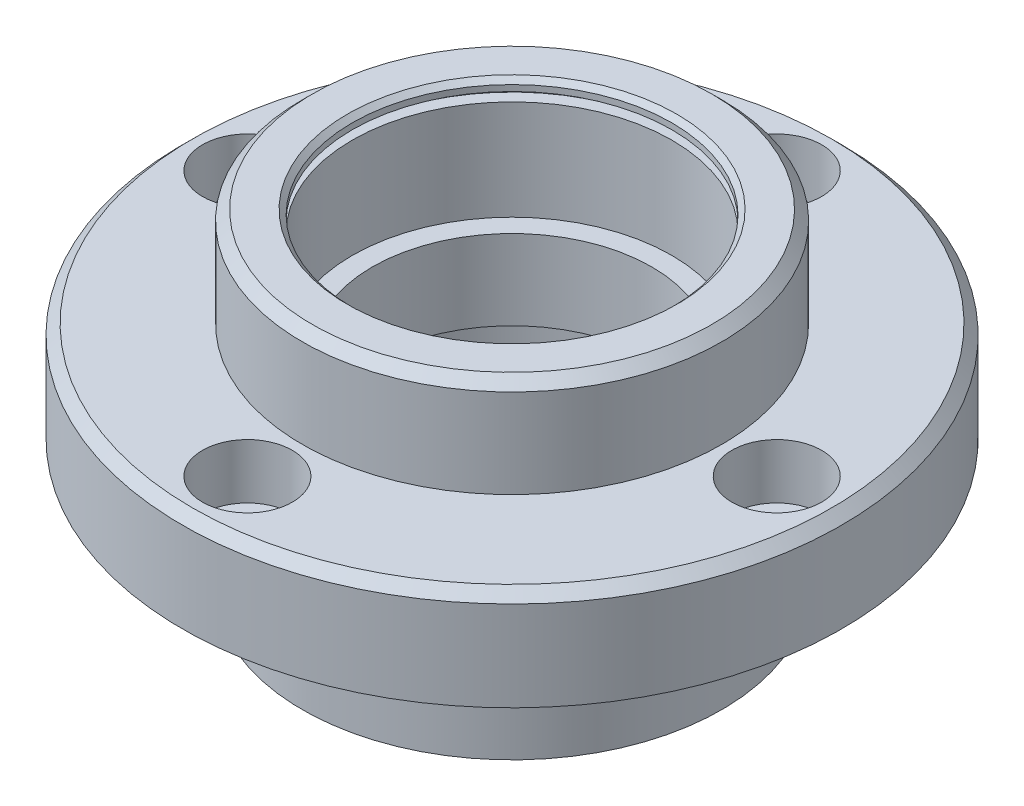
from build123d import *

# Parameters (mm, degrees)
HOLE_WIZARD_M5_1_D           = 5.5
HOLE_WIZARD_M5_1_CBORE_D     = 9
HOLE_WIZARD_M5_1_CBORE_DEPTH = 5.5
PATTERN_CIRCULAR_1_COUNT     = 4
CHAMFER_1_SIZE               = 1
CHAMFER_2_SIZE               = 0.5


with BuildPart() as part:
    # Sketch 1 → Revolve 1 (revolve)
    with BuildSketch(Plane.XY, mode=Mode.PRIVATE) as revolve_1_sk:
        Polygon((-33, 23), (-33, 13), (-21, 13), (-21, 0), (-16, 0), (-16, 2), (-17.2, 2), (-17.2, 2.9), (-16, 2.9), (-16, 12.9), (-14, 12.9), (-14, 20.9), (-16, 20.9), (-16, 30.9), (-17.2, 30.9), (-17.2, 31.8), (-16, 31.8), (-16, 32.9), (-21, 32.9), (-21, 23), align=None)
    revolve(revolve_1_sk.sketch.rotate(Axis((0, 0, 0), (0, 1, 0)), 270), axis=Axis((0, 0, 0), (0, 1, 0)))

    # Hole Wizard M5 _1 (through all)
    with Locations(Plane(origin=(0, 23, 0), x_dir=(1, 0, 0), z_dir=(0, 1, 0))):
        with Locations((-26.5, 0)):
            hole_wizard_m5_1 = CounterBoreHole(HOLE_WIZARD_M5_1_D / 2, HOLE_WIZARD_M5_1_CBORE_D / 2, HOLE_WIZARD_M5_1_CBORE_DEPTH)

    # Pattern Circular 1: Hole Wizard M5 _1 ×4 about axis
    pattern_circular_1_axis = Axis((0, 0, 0), (0, 1, 0))
    for i in range(1, PATTERN_CIRCULAR_1_COUNT):
        add(hole_wizard_m5_1.rotate(pattern_circular_1_axis, i * 360 / PATTERN_CIRCULAR_1_COUNT), mode=Mode.SUBTRACT)

    # Chamfer 1
    chamfer_1_edges = [part.edges().sort_by_distance(p)[0] for p in [
        (0, 32.9, 21),
        (0, 23, 33),
    ]]
    chamfer(chamfer_1_edges, length=CHAMFER_1_SIZE)

    # Chamfer 2
    chamfer_2_edges = [part.edges().sort_by_distance(p)[0] for p in [
        (0, 0, 16),
        (0, 32.9, 16),
    ]]
    chamfer(chamfer_2_edges, length=CHAMFER_2_SIZE)


solid = part.part
